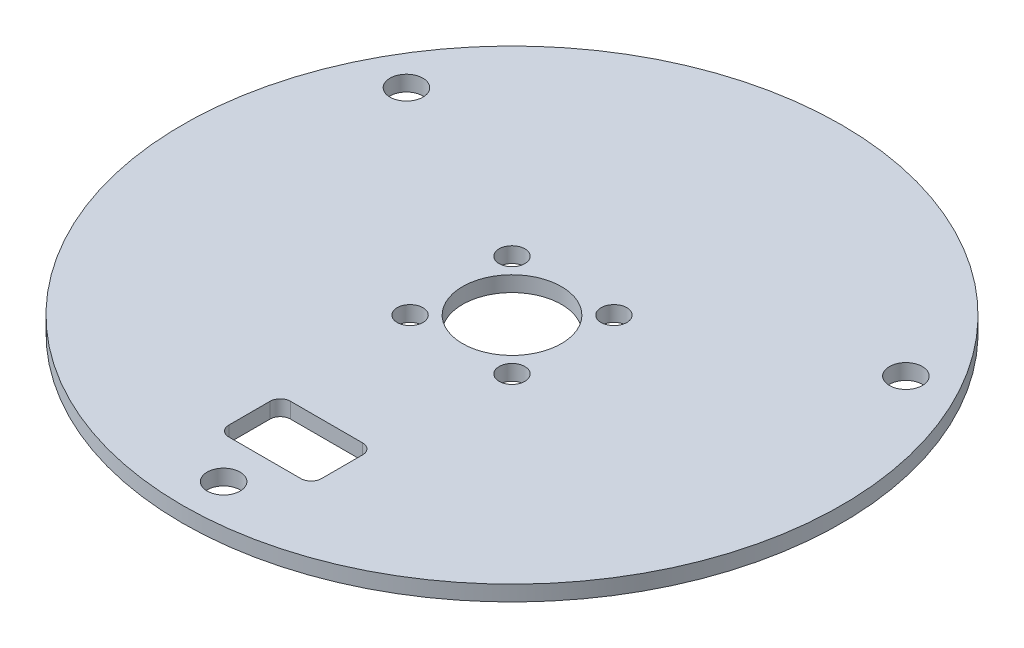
ISO-10303-21;
HEADER;
FILE_DESCRIPTION(('STEP AP214'),'2;1');
FILE_NAME('part.step','',(''),(''),'','','');
FILE_SCHEMA(('AUTOMOTIVE_DESIGN { 1 0 10303 214 1 1 1 1 }'));
ENDSEC;
DATA;
#1=APPLICATION_CONTEXT('core data for automotive mechanical design processes');
#2=APPLICATION_PROTOCOL_DEFINITION('international standard','automotive_design',2000,#1);
#3=PRODUCT_CONTEXT('',#1,'mechanical');
#4=PRODUCT('Part','Part','',(#3));
#5=PRODUCT_RELATED_PRODUCT_CATEGORY('part','',(#4));
#6=PRODUCT_DEFINITION_FORMATION('','',#4);
#7=PRODUCT_DEFINITION_CONTEXT('part definition',#1,'design');
#8=PRODUCT_DEFINITION('design','',#6,#7);
#9=PRODUCT_DEFINITION_SHAPE('','',#8);
#10=(LENGTH_UNIT() NAMED_UNIT(*) SI_UNIT(.MILLI.,.METRE.));
#11=(NAMED_UNIT(*) PLANE_ANGLE_UNIT() SI_UNIT($,.RADIAN.));
#12=(NAMED_UNIT(*) SI_UNIT($,.STERADIAN.) SOLID_ANGLE_UNIT());
#13=UNCERTAINTY_MEASURE_WITH_UNIT(LENGTH_MEASURE(1.E-05),#10,'distance_accuracy_value','');
#14=(GEOMETRIC_REPRESENTATION_CONTEXT(3) GLOBAL_UNCERTAINTY_ASSIGNED_CONTEXT((#13)) GLOBAL_UNIT_ASSIGNED_CONTEXT((#10,
#11,#12)) REPRESENTATION_CONTEXT('',''));
#15=CARTESIAN_POINT('',(0.,0.,0.));
#16=DIRECTION('',(0.,0.,1.));
#17=DIRECTION('',(1.,0.,0.));
#18=AXIS2_PLACEMENT_3D('',#15,#16,#17);
#19=CARTESIAN_POINT('',(0.,-1.5,0.));
#20=DIRECTION('',(0.,1.,0.));
#21=DIRECTION('',(0.,0.,1.));
#22=AXIS2_PLACEMENT_3D('',#19,#20,#21);
#23=CYLINDRICAL_SURFACE('',#22,32.);
#24=CARTESIAN_POINT('',(0.,-1.5,0.));
#25=DIRECTION('',(0.,1.,0.));
#26=DIRECTION('',(0.,0.,1.));
#27=AXIS2_PLACEMENT_3D('',#24,#25,#26);
#28=CIRCLE('',#27,32.);
#29=CARTESIAN_POINT('',(0.,-1.5,32.));
#30=VERTEX_POINT('',#29);
#31=EDGE_CURVE('E198',#30,#30,#28,.T.);
#32=ORIENTED_EDGE('',*,*,#31,.T.);
#33=EDGE_LOOP('',(#32));
#34=FACE_BOUND('',#33,.T.);
#35=CARTESIAN_POINT('',(0.,0.,0.));
#36=DIRECTION('',(0.,1.,0.));
#37=DIRECTION('',(0.,0.,1.));
#38=AXIS2_PLACEMENT_3D('',#35,#36,#37);
#39=CIRCLE('',#38,32.);
#40=CARTESIAN_POINT('',(0.,0.,32.));
#41=VERTEX_POINT('',#40);
#42=EDGE_CURVE('E183',#41,#41,#39,.T.);
#43=ORIENTED_EDGE('',*,*,#42,.F.);
#44=EDGE_LOOP('',(#43));
#45=FACE_BOUND('',#44,.T.);
#46=ADVANCED_FACE('F45',(#34,#45),#23,.T.);
#47=CARTESIAN_POINT('',(0.,-1.5,0.));
#48=DIRECTION('',(0.,1.,0.));
#49=DIRECTION('',(0.,0.,1.));
#50=AXIS2_PLACEMENT_3D('',#47,#48,#49);
#51=PLANE('',#50);
#52=DIRECTION('',(0.,0.,-1.));
#53=VECTOR('',#52,1.);
#54=CARTESIAN_POINT('',(4.5,-1.5,18.));
#55=LINE('',#54,#53);
#56=CARTESIAN_POINT('',(4.5,-1.5,23.));
#57=VERTEX_POINT('',#56);
#58=CARTESIAN_POINT('',(4.5,-1.5,19.));
#59=VERTEX_POINT('',#58);
#60=EDGE_CURVE('E233',#57,#59,#55,.T.);
#61=ORIENTED_EDGE('',*,*,#60,.T.);
#62=CARTESIAN_POINT('',(3.5,-1.5,19.));
#63=DIRECTION('',(0.,1.,0.));
#64=DIRECTION('',(0.,0.,1.));
#65=AXIS2_PLACEMENT_3D('',#62,#63,#64);
#66=CIRCLE('',#65,1.);
#67=CARTESIAN_POINT('',(3.5,-1.5,18.));
#68=VERTEX_POINT('',#67);
#69=EDGE_CURVE('E11',#59,#68,#66,.T.);
#70=ORIENTED_EDGE('',*,*,#69,.T.);
#71=DIRECTION('',(-1.,0.,0.));
#72=VECTOR('',#71,1.);
#73=CARTESIAN_POINT('',(-4.5,-1.5,18.));
#74=LINE('',#73,#72);
#75=CARTESIAN_POINT('',(-3.5,-1.5,18.));
#76=VERTEX_POINT('',#75);
#77=EDGE_CURVE('E173',#68,#76,#74,.T.);
#78=ORIENTED_EDGE('',*,*,#77,.T.);
#79=CARTESIAN_POINT('',(-3.5,-1.5,19.));
#80=DIRECTION('',(0.,1.,0.));
#81=DIRECTION('',(0.,0.,1.));
#82=AXIS2_PLACEMENT_3D('',#79,#80,#81);
#83=CIRCLE('',#82,1.);
#84=CARTESIAN_POINT('',(-4.5,-1.5,19.));
#85=VERTEX_POINT('',#84);
#86=EDGE_CURVE('E222',#76,#85,#83,.T.);
#87=ORIENTED_EDGE('',*,*,#86,.T.);
#88=DIRECTION('',(0.,0.,1.));
#89=VECTOR('',#88,1.);
#90=CARTESIAN_POINT('',(-4.5,-1.5,18.));
#91=LINE('',#90,#89);
#92=CARTESIAN_POINT('',(-4.5,-1.5,23.));
#93=VERTEX_POINT('',#92);
#94=EDGE_CURVE('E147',#85,#93,#91,.T.);
#95=ORIENTED_EDGE('',*,*,#94,.T.);
#96=CARTESIAN_POINT('',(-3.5,-1.5,23.));
#97=DIRECTION('',(0.,1.,0.));
#98=DIRECTION('',(0.,0.,1.));
#99=AXIS2_PLACEMENT_3D('',#96,#97,#98);
#100=CIRCLE('',#99,1.);
#101=CARTESIAN_POINT('',(-3.5,-1.5,24.));
#102=VERTEX_POINT('',#101);
#103=EDGE_CURVE('E120',#93,#102,#100,.T.);
#104=ORIENTED_EDGE('',*,*,#103,.T.);
#105=DIRECTION('',(1.,0.,0.));
#106=VECTOR('',#105,1.);
#107=CARTESIAN_POINT('',(-4.5,-1.5,24.));
#108=LINE('',#107,#106);
#109=CARTESIAN_POINT('',(3.5,-1.5,24.));
#110=VERTEX_POINT('',#109);
#111=EDGE_CURVE('E129',#102,#110,#108,.T.);
#112=ORIENTED_EDGE('',*,*,#111,.T.);
#113=CARTESIAN_POINT('',(3.5,-1.5,23.));
#114=DIRECTION('',(0.,1.,0.));
#115=DIRECTION('',(0.,0.,1.));
#116=AXIS2_PLACEMENT_3D('',#113,#114,#115);
#117=CIRCLE('',#116,1.);
#118=EDGE_CURVE('E218',#110,#57,#117,.T.);
#119=ORIENTED_EDGE('',*,*,#118,.T.);
#120=EDGE_LOOP('',(#61,#70,#78,#87,#95,#104,#112,#119));
#121=FACE_BOUND('',#120,.T.);
#122=CARTESIAN_POINT('',(-4.94974746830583,-1.5,4.94974746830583));
#123=DIRECTION('',(0.,1.,0.));
#124=DIRECTION('',(0.,0.,1.));
#125=AXIS2_PLACEMENT_3D('',#122,#123,#124);
#126=CIRCLE('',#125,1.25);
#127=CARTESIAN_POINT('',(-4.94974746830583,-1.5,6.19974746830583));
#128=VERTEX_POINT('',#127);
#129=EDGE_CURVE('E170',#128,#128,#126,.T.);
#130=ORIENTED_EDGE('',*,*,#129,.T.);
#131=EDGE_LOOP('',(#130));
#132=FACE_BOUND('',#131,.T.);
#133=CARTESIAN_POINT('',(4.94974746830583,-1.5,4.94974746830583));
#134=DIRECTION('',(0.,1.,0.));
#135=DIRECTION('',(0.,0.,1.));
#136=AXIS2_PLACEMENT_3D('',#133,#134,#135);
#137=CIRCLE('',#136,1.25);
#138=CARTESIAN_POINT('',(4.94974746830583,-1.5,6.19974746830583));
#139=VERTEX_POINT('',#138);
#140=EDGE_CURVE('E164',#139,#139,#137,.T.);
#141=ORIENTED_EDGE('',*,*,#140,.T.);
#142=EDGE_LOOP('',(#141));
#143=FACE_BOUND('',#142,.T.);
#144=CARTESIAN_POINT('',(4.94974746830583,-1.5,-4.94974746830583));
#145=DIRECTION('',(0.,1.,0.));
#146=DIRECTION('',(0.,0.,1.));
#147=AXIS2_PLACEMENT_3D('',#144,#145,#146);
#148=CIRCLE('',#147,1.25);
#149=CARTESIAN_POINT('',(4.94974746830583,-1.5,-3.69974746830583));
#150=VERTEX_POINT('',#149);
#151=EDGE_CURVE('E158',#150,#150,#148,.T.);
#152=ORIENTED_EDGE('',*,*,#151,.T.);
#153=EDGE_LOOP('',(#152));
#154=FACE_BOUND('',#153,.T.);
#155=CARTESIAN_POINT('',(-4.94974746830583,-1.5,-4.94974746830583));
#156=DIRECTION('',(0.,1.,0.));
#157=DIRECTION('',(0.,0.,1.));
#158=AXIS2_PLACEMENT_3D('',#155,#156,#157);
#159=CIRCLE('',#158,1.25);
#160=CARTESIAN_POINT('',(-4.94974746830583,-1.5,-3.69974746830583));
#161=VERTEX_POINT('',#160);
#162=EDGE_CURVE('E152',#161,#161,#159,.T.);
#163=ORIENTED_EDGE('',*,*,#162,.T.);
#164=EDGE_LOOP('',(#163));
#165=FACE_BOUND('',#164,.T.);
#166=CARTESIAN_POINT('',(0.,-1.5,0.));
#167=DIRECTION('',(0.,1.,0.));
#168=DIRECTION('',(0.,0.,1.));
#169=AXIS2_PLACEMENT_3D('',#166,#167,#168);
#170=CIRCLE('',#169,4.8);
#171=CARTESIAN_POINT('',(0.,-1.5,4.8));
#172=VERTEX_POINT('',#171);
#173=EDGE_CURVE('E174',#172,#172,#170,.T.);
#174=ORIENTED_EDGE('',*,*,#173,.T.);
#175=EDGE_LOOP('',(#174));
#176=FACE_BOUND('',#175,.T.);
#177=CARTESIAN_POINT('',(0.,-1.5,28.));
#178=DIRECTION('',(0.,1.,0.));
#179=DIRECTION('',(0.,0.,1.));
#180=AXIS2_PLACEMENT_3D('',#177,#178,#179);
#181=CIRCLE('',#180,1.6);
#182=CARTESIAN_POINT('',(0.,-1.5,29.6));
#183=VERTEX_POINT('',#182);
#184=EDGE_CURVE('E180',#183,#183,#181,.T.);
#185=ORIENTED_EDGE('',*,*,#184,.T.);
#186=EDGE_LOOP('',(#185));
#187=FACE_BOUND('',#186,.T.);
#188=CARTESIAN_POINT('',(-24.2487113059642,-1.5,-14.0000000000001));
#189=DIRECTION('',(0.,1.,0.));
#190=DIRECTION('',(0.,0.,1.));
#191=AXIS2_PLACEMENT_3D('',#188,#189,#190);
#192=CIRCLE('',#191,1.6);
#193=CARTESIAN_POINT('',(-24.2487113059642,-1.5,-12.4000000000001));
#194=VERTEX_POINT('',#193);
#195=EDGE_CURVE('E190',#194,#194,#192,.T.);
#196=ORIENTED_EDGE('',*,*,#195,.T.);
#197=EDGE_LOOP('',(#196));
#198=FACE_BOUND('',#197,.T.);
#199=CARTESIAN_POINT('',(24.2487113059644,-1.5,-13.9999999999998));
#200=DIRECTION('',(0.,1.,0.));
#201=DIRECTION('',(0.,0.,1.));
#202=AXIS2_PLACEMENT_3D('',#199,#200,#201);
#203=CIRCLE('',#202,1.6);
#204=CARTESIAN_POINT('',(24.2487113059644,-1.5,-12.3999999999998));
#205=VERTEX_POINT('',#204);
#206=EDGE_CURVE('E177',#205,#205,#203,.T.);
#207=ORIENTED_EDGE('',*,*,#206,.T.);
#208=EDGE_LOOP('',(#207));
#209=FACE_BOUND('',#208,.T.);
#210=ORIENTED_EDGE('',*,*,#31,.F.);
#211=EDGE_LOOP('',(#210));
#212=FACE_BOUND('',#211,.T.);
#213=ADVANCED_FACE('F239',(#121,#132,#143,#154,#165,#176,#187,#198,#209,#212),#51,.F.);
#214=CARTESIAN_POINT('',(0.,0.,0.));
#215=DIRECTION('',(0.,1.,0.));
#216=DIRECTION('',(0.,0.,1.));
#217=AXIS2_PLACEMENT_3D('',#214,#215,#216);
#218=PLANE('',#217);
#219=DIRECTION('',(0.,0.,1.));
#220=VECTOR('',#219,1.);
#221=CARTESIAN_POINT('',(-4.5,0.,18.));
#222=LINE('',#221,#220);
#223=CARTESIAN_POINT('',(-4.5,0.,19.));
#224=VERTEX_POINT('',#223);
#225=CARTESIAN_POINT('',(-4.5,0.,23.));
#226=VERTEX_POINT('',#225);
#227=EDGE_CURVE('E138',#224,#226,#222,.T.);
#228=ORIENTED_EDGE('',*,*,#227,.F.);
#229=CARTESIAN_POINT('',(-3.5,0.,19.));
#230=DIRECTION('',(0.,1.,0.));
#231=DIRECTION('',(0.,0.,1.));
#232=AXIS2_PLACEMENT_3D('',#229,#230,#231);
#233=CIRCLE('',#232,1.);
#234=CARTESIAN_POINT('',(-3.5,0.,18.));
#235=VERTEX_POINT('',#234);
#236=EDGE_CURVE('E220',#224,#235,#233,.F.);
#237=ORIENTED_EDGE('',*,*,#236,.T.);
#238=DIRECTION('',(-1.,0.,0.));
#239=VECTOR('',#238,1.);
#240=CARTESIAN_POINT('',(-4.5,0.,18.));
#241=LINE('',#240,#239);
#242=CARTESIAN_POINT('',(3.5,0.,18.));
#243=VERTEX_POINT('',#242);
#244=EDGE_CURVE('E141',#243,#235,#241,.T.);
#245=ORIENTED_EDGE('',*,*,#244,.F.);
#246=CARTESIAN_POINT('',(3.5,0.,19.));
#247=DIRECTION('',(0.,1.,0.));
#248=DIRECTION('',(0.,0.,1.));
#249=AXIS2_PLACEMENT_3D('',#246,#247,#248);
#250=CIRCLE('',#249,1.);
#251=CARTESIAN_POINT('',(4.5,0.,19.));
#252=VERTEX_POINT('',#251);
#253=EDGE_CURVE('E53',#243,#252,#250,.F.);
#254=ORIENTED_EDGE('',*,*,#253,.T.);
#255=DIRECTION('',(0.,0.,-1.));
#256=VECTOR('',#255,1.);
#257=CARTESIAN_POINT('',(4.5,0.,18.));
#258=LINE('',#257,#256);
#259=CARTESIAN_POINT('',(4.5,0.,23.));
#260=VERTEX_POINT('',#259);
#261=EDGE_CURVE('E137',#260,#252,#258,.T.);
#262=ORIENTED_EDGE('',*,*,#261,.F.);
#263=CARTESIAN_POINT('',(3.5,0.,23.));
#264=DIRECTION('',(0.,1.,0.));
#265=DIRECTION('',(0.,0.,1.));
#266=AXIS2_PLACEMENT_3D('',#263,#264,#265);
#267=CIRCLE('',#266,1.);
#268=CARTESIAN_POINT('',(3.5,0.,24.));
#269=VERTEX_POINT('',#268);
#270=EDGE_CURVE('E136',#260,#269,#267,.F.);
#271=ORIENTED_EDGE('',*,*,#270,.T.);
#272=DIRECTION('',(1.,0.,0.));
#273=VECTOR('',#272,1.);
#274=CARTESIAN_POINT('',(-4.5,0.,24.));
#275=LINE('',#274,#273);
#276=CARTESIAN_POINT('',(-3.5,0.,24.));
#277=VERTEX_POINT('',#276);
#278=EDGE_CURVE('E126',#277,#269,#275,.T.);
#279=ORIENTED_EDGE('',*,*,#278,.F.);
#280=CARTESIAN_POINT('',(-3.5,0.,23.));
#281=DIRECTION('',(0.,1.,0.));
#282=DIRECTION('',(0.,0.,1.));
#283=AXIS2_PLACEMENT_3D('',#280,#281,#282);
#284=CIRCLE('',#283,1.);
#285=EDGE_CURVE('E110',#277,#226,#284,.F.);
#286=ORIENTED_EDGE('',*,*,#285,.T.);
#287=EDGE_LOOP('',(#228,#237,#245,#254,#262,#271,#279,#286));
#288=FACE_BOUND('',#287,.T.);
#289=CARTESIAN_POINT('',(-4.94974746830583,0.,4.94974746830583));
#290=DIRECTION('',(0.,1.,0.));
#291=DIRECTION('',(0.,0.,1.));
#292=AXIS2_PLACEMENT_3D('',#289,#290,#291);
#293=CIRCLE('',#292,1.25);
#294=CARTESIAN_POINT('',(-4.94974746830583,0.,6.19974746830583));
#295=VERTEX_POINT('',#294);
#296=EDGE_CURVE('E167',#295,#295,#293,.T.);
#297=ORIENTED_EDGE('',*,*,#296,.F.);
#298=EDGE_LOOP('',(#297));
#299=FACE_BOUND('',#298,.T.);
#300=CARTESIAN_POINT('',(4.94974746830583,0.,4.94974746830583));
#301=DIRECTION('',(0.,1.,0.));
#302=DIRECTION('',(0.,0.,1.));
#303=AXIS2_PLACEMENT_3D('',#300,#301,#302);
#304=CIRCLE('',#303,1.25);
#305=CARTESIAN_POINT('',(4.94974746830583,0.,6.19974746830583));
#306=VERTEX_POINT('',#305);
#307=EDGE_CURVE('E161',#306,#306,#304,.T.);
#308=ORIENTED_EDGE('',*,*,#307,.F.);
#309=EDGE_LOOP('',(#308));
#310=FACE_BOUND('',#309,.T.);
#311=CARTESIAN_POINT('',(4.94974746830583,0.,-4.94974746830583));
#312=DIRECTION('',(0.,1.,0.));
#313=DIRECTION('',(0.,0.,1.));
#314=AXIS2_PLACEMENT_3D('',#311,#312,#313);
#315=CIRCLE('',#314,1.25);
#316=CARTESIAN_POINT('',(4.94974746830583,0.,-3.69974746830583));
#317=VERTEX_POINT('',#316);
#318=EDGE_CURVE('E155',#317,#317,#315,.T.);
#319=ORIENTED_EDGE('',*,*,#318,.F.);
#320=EDGE_LOOP('',(#319));
#321=FACE_BOUND('',#320,.T.);
#322=CARTESIAN_POINT('',(-4.94974746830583,0.,-4.94974746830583));
#323=DIRECTION('',(0.,1.,0.));
#324=DIRECTION('',(0.,0.,1.));
#325=AXIS2_PLACEMENT_3D('',#322,#323,#324);
#326=CIRCLE('',#325,1.25);
#327=CARTESIAN_POINT('',(-4.94974746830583,0.,-3.69974746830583));
#328=VERTEX_POINT('',#327);
#329=EDGE_CURVE('E148',#328,#328,#326,.T.);
#330=ORIENTED_EDGE('',*,*,#329,.F.);
#331=EDGE_LOOP('',(#330));
#332=FACE_BOUND('',#331,.T.);
#333=CARTESIAN_POINT('',(0.,0.,0.));
#334=DIRECTION('',(0.,1.,0.));
#335=DIRECTION('',(0.,0.,1.));
#336=AXIS2_PLACEMENT_3D('',#333,#334,#335);
#337=CIRCLE('',#336,4.8);
#338=CARTESIAN_POINT('',(0.,0.,4.8));
#339=VERTEX_POINT('',#338);
#340=EDGE_CURVE('E151',#339,#339,#337,.T.);
#341=ORIENTED_EDGE('',*,*,#340,.F.);
#342=EDGE_LOOP('',(#341));
#343=FACE_BOUND('',#342,.T.);
#344=CARTESIAN_POINT('',(0.,0.,28.));
#345=DIRECTION('',(0.,1.,0.));
#346=DIRECTION('',(0.,0.,1.));
#347=AXIS2_PLACEMENT_3D('',#344,#345,#346);
#348=CIRCLE('',#347,1.6);
#349=CARTESIAN_POINT('',(0.,0.,29.6));
#350=VERTEX_POINT('',#349);
#351=EDGE_CURVE('E184',#350,#350,#348,.T.);
#352=ORIENTED_EDGE('',*,*,#351,.F.);
#353=EDGE_LOOP('',(#352));
#354=FACE_BOUND('',#353,.T.);
#355=CARTESIAN_POINT('',(-24.2487113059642,0.,-14.0000000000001));
#356=DIRECTION('',(0.,1.,0.));
#357=DIRECTION('',(0.,0.,1.));
#358=AXIS2_PLACEMENT_3D('',#355,#356,#357);
#359=CIRCLE('',#358,1.6);
#360=CARTESIAN_POINT('',(-24.2487113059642,0.,-12.4000000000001));
#361=VERTEX_POINT('',#360);
#362=EDGE_CURVE('E187',#361,#361,#359,.T.);
#363=ORIENTED_EDGE('',*,*,#362,.F.);
#364=EDGE_LOOP('',(#363));
#365=FACE_BOUND('',#364,.T.);
#366=CARTESIAN_POINT('',(24.2487113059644,0.,-13.9999999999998));
#367=DIRECTION('',(0.,1.,0.));
#368=DIRECTION('',(0.,0.,1.));
#369=AXIS2_PLACEMENT_3D('',#366,#367,#368);
#370=CIRCLE('',#369,1.6);
#371=CARTESIAN_POINT('',(24.2487113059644,0.,-12.3999999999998));
#372=VERTEX_POINT('',#371);
#373=EDGE_CURVE('E193',#372,#372,#370,.T.);
#374=ORIENTED_EDGE('',*,*,#373,.F.);
#375=EDGE_LOOP('',(#374));
#376=FACE_BOUND('',#375,.T.);
#377=ORIENTED_EDGE('',*,*,#42,.T.);
#378=EDGE_LOOP('',(#377));
#379=FACE_BOUND('',#378,.T.);
#380=ADVANCED_FACE('F133',(#288,#299,#310,#321,#332,#343,#354,#365,#376,#379),#218,.T.);
#381=CARTESIAN_POINT('',(24.2487113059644,-1.5,-13.9999999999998));
#382=DIRECTION('',(0.,1.,0.));
#383=DIRECTION('',(0.,0.,1.));
#384=AXIS2_PLACEMENT_3D('',#381,#382,#383);
#385=CYLINDRICAL_SURFACE('',#384,1.6);
#386=ORIENTED_EDGE('',*,*,#206,.F.);
#387=EDGE_LOOP('',(#386));
#388=FACE_BOUND('',#387,.T.);
#389=ORIENTED_EDGE('',*,*,#373,.T.);
#390=EDGE_LOOP('',(#389));
#391=FACE_BOUND('',#390,.T.);
#392=ADVANCED_FACE('F305',(#388,#391),#385,.F.);
#393=CARTESIAN_POINT('',(-24.2487113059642,-1.5,-14.0000000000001));
#394=DIRECTION('',(0.,1.,0.));
#395=DIRECTION('',(0.,0.,1.));
#396=AXIS2_PLACEMENT_3D('',#393,#394,#395);
#397=CYLINDRICAL_SURFACE('',#396,1.6);
#398=ORIENTED_EDGE('',*,*,#195,.F.);
#399=EDGE_LOOP('',(#398));
#400=FACE_BOUND('',#399,.T.);
#401=ORIENTED_EDGE('',*,*,#362,.T.);
#402=EDGE_LOOP('',(#401));
#403=FACE_BOUND('',#402,.T.);
#404=ADVANCED_FACE('F301',(#400,#403),#397,.F.);
#405=CARTESIAN_POINT('',(0.,-1.5,28.));
#406=DIRECTION('',(0.,1.,0.));
#407=DIRECTION('',(0.,0.,1.));
#408=AXIS2_PLACEMENT_3D('',#405,#406,#407);
#409=CYLINDRICAL_SURFACE('',#408,1.6);
#410=ORIENTED_EDGE('',*,*,#184,.F.);
#411=EDGE_LOOP('',(#410));
#412=FACE_BOUND('',#411,.T.);
#413=ORIENTED_EDGE('',*,*,#351,.T.);
#414=EDGE_LOOP('',(#413));
#415=FACE_BOUND('',#414,.T.);
#416=ADVANCED_FACE('F297',(#412,#415),#409,.F.);
#417=CARTESIAN_POINT('',(0.,-1.5,0.));
#418=DIRECTION('',(0.,1.,0.));
#419=DIRECTION('',(0.,0.,1.));
#420=AXIS2_PLACEMENT_3D('',#417,#418,#419);
#421=CYLINDRICAL_SURFACE('',#420,4.8);
#422=ORIENTED_EDGE('',*,*,#173,.F.);
#423=EDGE_LOOP('',(#422));
#424=FACE_BOUND('',#423,.T.);
#425=ORIENTED_EDGE('',*,*,#340,.T.);
#426=EDGE_LOOP('',(#425));
#427=FACE_BOUND('',#426,.T.);
#428=ADVANCED_FACE('F283',(#424,#427),#421,.F.);
#429=CARTESIAN_POINT('',(-4.94974746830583,-1.5,-4.94974746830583));
#430=DIRECTION('',(0.,1.,0.));
#431=DIRECTION('',(0.,0.,1.));
#432=AXIS2_PLACEMENT_3D('',#429,#430,#431);
#433=CYLINDRICAL_SURFACE('',#432,1.25);
#434=ORIENTED_EDGE('',*,*,#162,.F.);
#435=EDGE_LOOP('',(#434));
#436=FACE_BOUND('',#435,.T.);
#437=ORIENTED_EDGE('',*,*,#329,.T.);
#438=EDGE_LOOP('',(#437));
#439=FACE_BOUND('',#438,.T.);
#440=ADVANCED_FACE('F279',(#436,#439),#433,.F.);
#441=CARTESIAN_POINT('',(4.94974746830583,-1.5,-4.94974746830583));
#442=DIRECTION('',(0.,1.,0.));
#443=DIRECTION('',(0.,0.,1.));
#444=AXIS2_PLACEMENT_3D('',#441,#442,#443);
#445=CYLINDRICAL_SURFACE('',#444,1.25);
#446=ORIENTED_EDGE('',*,*,#151,.F.);
#447=EDGE_LOOP('',(#446));
#448=FACE_BOUND('',#447,.T.);
#449=ORIENTED_EDGE('',*,*,#318,.T.);
#450=EDGE_LOOP('',(#449));
#451=FACE_BOUND('',#450,.T.);
#452=ADVANCED_FACE('F282',(#448,#451),#445,.F.);
#453=CARTESIAN_POINT('',(4.94974746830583,-1.5,4.94974746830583));
#454=DIRECTION('',(0.,1.,0.));
#455=DIRECTION('',(0.,0.,1.));
#456=AXIS2_PLACEMENT_3D('',#453,#454,#455);
#457=CYLINDRICAL_SURFACE('',#456,1.25);
#458=ORIENTED_EDGE('',*,*,#140,.F.);
#459=EDGE_LOOP('',(#458));
#460=FACE_BOUND('',#459,.T.);
#461=ORIENTED_EDGE('',*,*,#307,.T.);
#462=EDGE_LOOP('',(#461));
#463=FACE_BOUND('',#462,.T.);
#464=ADVANCED_FACE('F287',(#460,#463),#457,.F.);
#465=CARTESIAN_POINT('',(-4.94974746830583,-1.5,4.94974746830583));
#466=DIRECTION('',(0.,1.,0.));
#467=DIRECTION('',(0.,0.,1.));
#468=AXIS2_PLACEMENT_3D('',#465,#466,#467);
#469=CYLINDRICAL_SURFACE('',#468,1.25);
#470=ORIENTED_EDGE('',*,*,#129,.F.);
#471=EDGE_LOOP('',(#470));
#472=FACE_BOUND('',#471,.T.);
#473=ORIENTED_EDGE('',*,*,#296,.T.);
#474=EDGE_LOOP('',(#473));
#475=FACE_BOUND('',#474,.T.);
#476=ADVANCED_FACE('F278',(#472,#475),#469,.F.);
#477=CARTESIAN_POINT('',(-4.5,-1.5,18.));
#478=DIRECTION('',(-1.,0.,0.));
#479=DIRECTION('',(0.,0.,1.));
#480=AXIS2_PLACEMENT_3D('',#477,#478,#479);
#481=PLANE('',#480);
#482=ORIENTED_EDGE('',*,*,#227,.T.);
#483=DIRECTION('',(0.,1.,0.));
#484=VECTOR('',#483,1.);
#485=CARTESIAN_POINT('',(-4.5,-1.5,23.));
#486=LINE('',#485,#484);
#487=EDGE_CURVE('E115',#226,#93,#486,.F.);
#488=ORIENTED_EDGE('',*,*,#487,.T.);
#489=ORIENTED_EDGE('',*,*,#94,.F.);
#490=DIRECTION('',(0.,1.,0.));
#491=VECTOR('',#490,1.);
#492=CARTESIAN_POINT('',(-4.5,0.,19.));
#493=LINE('',#492,#491);
#494=EDGE_CURVE('E130',#85,#224,#493,.T.);
#495=ORIENTED_EDGE('',*,*,#494,.T.);
#496=EDGE_LOOP('',(#482,#488,#489,#495));
#497=FACE_BOUND('',#496,.T.);
#498=ADVANCED_FACE('F243',(#497),#481,.F.);
#499=CARTESIAN_POINT('',(-4.5,-1.5,18.));
#500=DIRECTION('',(0.,0.,-1.));
#501=DIRECTION('',(-1.,0.,0.));
#502=AXIS2_PLACEMENT_3D('',#499,#500,#501);
#503=PLANE('',#502);
#504=ORIENTED_EDGE('',*,*,#244,.T.);
#505=DIRECTION('',(0.,1.,0.));
#506=VECTOR('',#505,1.);
#507=CARTESIAN_POINT('',(-3.5,-1.5,18.));
#508=LINE('',#507,#506);
#509=EDGE_CURVE('E60',#235,#76,#508,.F.);
#510=ORIENTED_EDGE('',*,*,#509,.T.);
#511=ORIENTED_EDGE('',*,*,#77,.F.);
#512=DIRECTION('',(0.,1.,0.));
#513=VECTOR('',#512,1.);
#514=CARTESIAN_POINT('',(3.5,0.,18.));
#515=LINE('',#514,#513);
#516=EDGE_CURVE('E212',#68,#243,#515,.T.);
#517=ORIENTED_EDGE('',*,*,#516,.T.);
#518=EDGE_LOOP('',(#504,#510,#511,#517));
#519=FACE_BOUND('',#518,.T.);
#520=ADVANCED_FACE('F231',(#519),#503,.F.);
#521=CARTESIAN_POINT('',(4.5,-1.5,18.));
#522=DIRECTION('',(1.,0.,0.));
#523=DIRECTION('',(0.,0.,-1.));
#524=AXIS2_PLACEMENT_3D('',#521,#522,#523);
#525=PLANE('',#524);
#526=ORIENTED_EDGE('',*,*,#60,.F.);
#527=DIRECTION('',(0.,1.,0.));
#528=VECTOR('',#527,1.);
#529=CARTESIAN_POINT('',(4.5,0.,23.));
#530=LINE('',#529,#528);
#531=EDGE_CURVE('E209',#57,#260,#530,.T.);
#532=ORIENTED_EDGE('',*,*,#531,.T.);
#533=ORIENTED_EDGE('',*,*,#261,.T.);
#534=DIRECTION('',(0.,1.,0.));
#535=VECTOR('',#534,1.);
#536=CARTESIAN_POINT('',(4.5,-1.5,19.));
#537=LINE('',#536,#535);
#538=EDGE_CURVE('E207',#252,#59,#537,.F.);
#539=ORIENTED_EDGE('',*,*,#538,.T.);
#540=EDGE_LOOP('',(#526,#532,#533,#539));
#541=FACE_BOUND('',#540,.T.);
#542=ADVANCED_FACE('F229',(#541),#525,.F.);
#543=CARTESIAN_POINT('',(-4.5,-1.5,24.));
#544=DIRECTION('',(0.,0.,1.));
#545=DIRECTION('',(1.,0.,0.));
#546=AXIS2_PLACEMENT_3D('',#543,#544,#545);
#547=PLANE('',#546);
#548=ORIENTED_EDGE('',*,*,#111,.F.);
#549=DIRECTION('',(0.,1.,0.));
#550=VECTOR('',#549,1.);
#551=CARTESIAN_POINT('',(-3.5,0.,24.));
#552=LINE('',#551,#550);
#553=EDGE_CURVE('E114',#102,#277,#552,.T.);
#554=ORIENTED_EDGE('',*,*,#553,.T.);
#555=ORIENTED_EDGE('',*,*,#278,.T.);
#556=DIRECTION('',(0.,1.,0.));
#557=VECTOR('',#556,1.);
#558=CARTESIAN_POINT('',(3.5,-1.5,24.));
#559=LINE('',#558,#557);
#560=EDGE_CURVE('E131',#269,#110,#559,.F.);
#561=ORIENTED_EDGE('',*,*,#560,.T.);
#562=EDGE_LOOP('',(#548,#554,#555,#561));
#563=FACE_BOUND('',#562,.T.);
#564=ADVANCED_FACE('F125',(#563),#547,.F.);
#565=CARTESIAN_POINT('',(-3.5,-1.5,23.));
#566=DIRECTION('',(0.,-1.,0.));
#567=DIRECTION('',(0.,0.,-1.));
#568=AXIS2_PLACEMENT_3D('',#565,#566,#567);
#569=CYLINDRICAL_SURFACE('',#568,1.);
#570=ORIENTED_EDGE('',*,*,#103,.F.);
#571=ORIENTED_EDGE('',*,*,#487,.F.);
#572=ORIENTED_EDGE('',*,*,#285,.F.);
#573=ORIENTED_EDGE('',*,*,#553,.F.);
#574=EDGE_LOOP('',(#570,#571,#572,#573));
#575=FACE_BOUND('',#574,.T.);
#576=ADVANCED_FACE('F113',(#575),#569,.F.);
#577=CARTESIAN_POINT('',(3.5,-1.5,23.));
#578=DIRECTION('',(0.,-1.,0.));
#579=DIRECTION('',(0.,0.,-1.));
#580=AXIS2_PLACEMENT_3D('',#577,#578,#579);
#581=CYLINDRICAL_SURFACE('',#580,1.);
#582=ORIENTED_EDGE('',*,*,#118,.F.);
#583=ORIENTED_EDGE('',*,*,#560,.F.);
#584=ORIENTED_EDGE('',*,*,#270,.F.);
#585=ORIENTED_EDGE('',*,*,#531,.F.);
#586=EDGE_LOOP('',(#582,#583,#584,#585));
#587=FACE_BOUND('',#586,.T.);
#588=ADVANCED_FACE('F247',(#587),#581,.F.);
#589=CARTESIAN_POINT('',(-3.5,-1.5,19.));
#590=DIRECTION('',(0.,-1.,0.));
#591=DIRECTION('',(0.,0.,-1.));
#592=AXIS2_PLACEMENT_3D('',#589,#590,#591);
#593=CYLINDRICAL_SURFACE('',#592,1.);
#594=ORIENTED_EDGE('',*,*,#86,.F.);
#595=ORIENTED_EDGE('',*,*,#509,.F.);
#596=ORIENTED_EDGE('',*,*,#236,.F.);
#597=ORIENTED_EDGE('',*,*,#494,.F.);
#598=EDGE_LOOP('',(#594,#595,#596,#597));
#599=FACE_BOUND('',#598,.T.);
#600=ADVANCED_FACE('F245',(#599),#593,.F.);
#601=CARTESIAN_POINT('',(3.5,-1.5,19.));
#602=DIRECTION('',(0.,-1.,0.));
#603=DIRECTION('',(0.,0.,-1.));
#604=AXIS2_PLACEMENT_3D('',#601,#602,#603);
#605=CYLINDRICAL_SURFACE('',#604,1.);
#606=ORIENTED_EDGE('',*,*,#69,.F.);
#607=ORIENTED_EDGE('',*,*,#538,.F.);
#608=ORIENTED_EDGE('',*,*,#253,.F.);
#609=ORIENTED_EDGE('',*,*,#516,.F.);
#610=EDGE_LOOP('',(#606,#607,#608,#609));
#611=FACE_BOUND('',#610,.T.);
#612=ADVANCED_FACE('F47',(#611),#605,.F.);
#613=CLOSED_SHELL('',(#46,#213,#380,#392,#404,#416,#428,#440,#452,#464,#476,#498,#520,#542,#564,
#576,#588,#600,#612));
#614=MANIFOLD_SOLID_BREP('B2',#613);
#615=ADVANCED_BREP_SHAPE_REPRESENTATION('',(#18,#614),#14);
#616=SHAPE_DEFINITION_REPRESENTATION(#9,#615);
ENDSEC;
END-ISO-10303-21;
